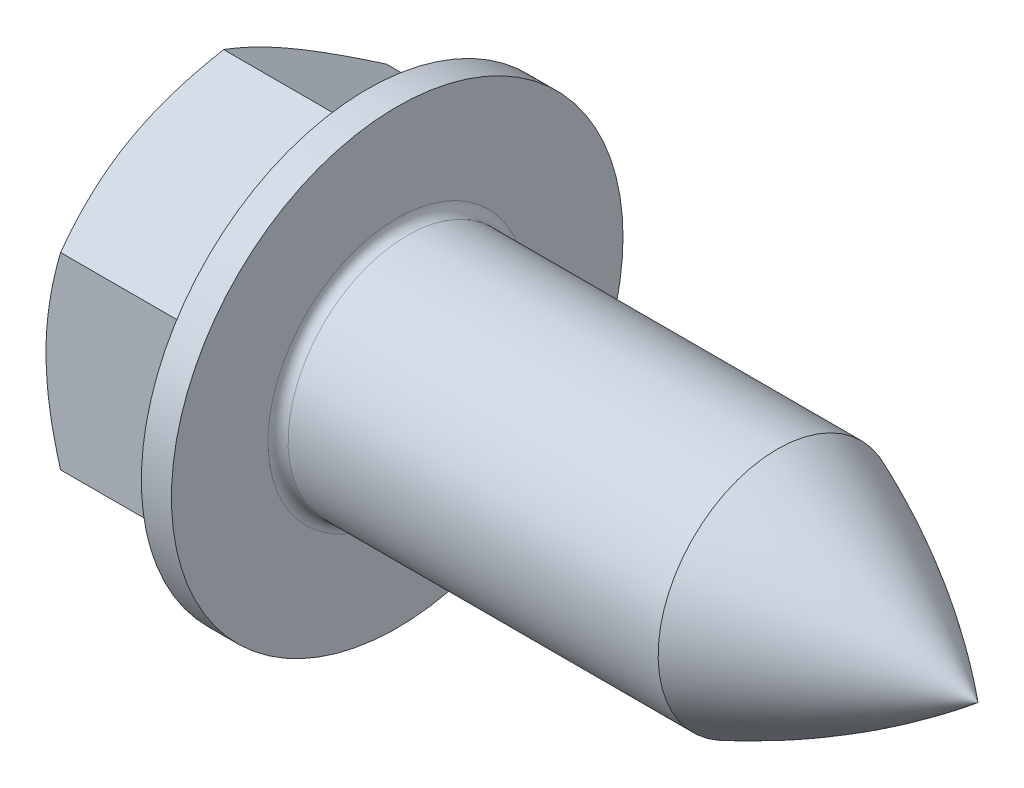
ISO-10303-21;
HEADER;
FILE_DESCRIPTION(('STEP AP214'),'2;1');
FILE_NAME('part.step','',(''),(''),'','','');
FILE_SCHEMA(('AUTOMOTIVE_DESIGN { 1 0 10303 214 1 1 1 1 }'));
ENDSEC;
DATA;
#1=APPLICATION_CONTEXT('core data for automotive mechanical design processes');
#2=APPLICATION_PROTOCOL_DEFINITION('international standard','automotive_design',2000,#1);
#3=PRODUCT_CONTEXT('',#1,'mechanical');
#4=PRODUCT('Part','Part','',(#3));
#5=PRODUCT_RELATED_PRODUCT_CATEGORY('part','',(#4));
#6=PRODUCT_DEFINITION_FORMATION('','',#4);
#7=PRODUCT_DEFINITION_CONTEXT('part definition',#1,'design');
#8=PRODUCT_DEFINITION('design','',#6,#7);
#9=PRODUCT_DEFINITION_SHAPE('','',#8);
#10=(LENGTH_UNIT() NAMED_UNIT(*) SI_UNIT(.MILLI.,.METRE.));
#11=(NAMED_UNIT(*) PLANE_ANGLE_UNIT() SI_UNIT($,.RADIAN.));
#12=(NAMED_UNIT(*) SI_UNIT($,.STERADIAN.) SOLID_ANGLE_UNIT());
#13=UNCERTAINTY_MEASURE_WITH_UNIT(LENGTH_MEASURE(1.E-05),#10,'distance_accuracy_value','');
#14=(GEOMETRIC_REPRESENTATION_CONTEXT(3) GLOBAL_UNCERTAINTY_ASSIGNED_CONTEXT((#13)) GLOBAL_UNIT_ASSIGNED_CONTEXT((#10,
#11,#12)) REPRESENTATION_CONTEXT('',''));
#15=CARTESIAN_POINT('',(0.,0.,0.));
#16=DIRECTION('',(0.,0.,1.));
#17=DIRECTION('',(1.,0.,0.));
#18=AXIS2_PLACEMENT_3D('',#15,#16,#17);
#19=CARTESIAN_POINT('',(-9.54447010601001,0.,0.));
#20=DIRECTION('',(-1.,0.,0.));
#21=DIRECTION('',(0.,0.,1.));
#22=AXIS2_PLACEMENT_3D('',#19,#20,#21);
#23=CYLINDRICAL_SURFACE('',#22,4.75);
#24=CARTESIAN_POINT('',(7.9,0.,0.));
#25=DIRECTION('',(1.,0.,0.));
#26=DIRECTION('',(0.,0.,-1.));
#27=AXIS2_PLACEMENT_3D('',#24,#25,#26);
#28=CIRCLE('',#27,4.75);
#29=CARTESIAN_POINT('',(7.9,0.,-4.75));
#30=VERTEX_POINT('',#29);
#31=EDGE_CURVE('E323',#30,#30,#28,.T.);
#32=ORIENTED_EDGE('',*,*,#31,.T.);
#33=EDGE_LOOP('',(#32));
#34=FACE_BOUND('',#33,.T.);
#35=CARTESIAN_POINT('',(22.65,0.,0.));
#36=DIRECTION('',(1.,0.,0.));
#37=DIRECTION('',(0.,1.,0.));
#38=AXIS2_PLACEMENT_3D('',#35,#36,#37);
#39=CIRCLE('',#38,4.75);
#40=CARTESIAN_POINT('',(22.65,4.75,0.));
#41=VERTEX_POINT('',#40);
#42=EDGE_CURVE('E301',#41,#41,#39,.T.);
#43=ORIENTED_EDGE('',*,*,#42,.F.);
#44=EDGE_LOOP('',(#43));
#45=FACE_BOUND('',#44,.T.);
#46=ADVANCED_FACE('F38',(#34,#45),#23,.T.);
#47=CARTESIAN_POINT('',(7.5,7.50555349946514,0.));
#48=DIRECTION('',(1.,0.,0.));
#49=DIRECTION('',(0.,0.,-1.));
#50=AXIS2_PLACEMENT_3D('',#47,#48,#49);
#51=PLANE('',#50);
#52=CARTESIAN_POINT('',(7.5,0.,0.));
#53=DIRECTION('',(1.,0.,0.));
#54=DIRECTION('',(0.,0.,-1.));
#55=AXIS2_PLACEMENT_3D('',#52,#53,#54);
#56=CIRCLE('',#55,5.15);
#57=CARTESIAN_POINT('',(7.5,0.,-5.15));
#58=VERTEX_POINT('',#57);
#59=EDGE_CURVE('E324',#58,#58,#56,.F.);
#60=ORIENTED_EDGE('',*,*,#59,.T.);
#61=EDGE_LOOP('',(#60));
#62=FACE_BOUND('',#61,.T.);
#63=CARTESIAN_POINT('',(7.49999999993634,0.,0.));
#64=DIRECTION('',(1.,0.,0.));
#65=DIRECTION('',(0.,0.,-1.));
#66=AXIS2_PLACEMENT_3D('',#63,#64,#65);
#67=CIRCLE('',#66,9.);
#68=CARTESIAN_POINT('',(7.49999999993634,0.,-9.));
#69=VERTEX_POINT('',#68);
#70=EDGE_CURVE('E346',#69,#69,#67,.T.);
#71=ORIENTED_EDGE('',*,*,#70,.T.);
#72=EDGE_LOOP('',(#71));
#73=FACE_BOUND('',#72,.T.);
#74=ADVANCED_FACE('F148',(#62,#73),#51,.T.);
#75=CARTESIAN_POINT('',(6.29999999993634,0.,0.));
#76=DIRECTION('',(1.,0.,0.));
#77=DIRECTION('',(0.,0.,-1.));
#78=AXIS2_PLACEMENT_3D('',#75,#76,#77);
#79=PLANE('',#78);
#80=DIRECTION('',(0.,-0.5,-0.866025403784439));
#81=VECTOR('',#80,1.);
#82=CARTESIAN_POINT('',(6.29999999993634,-8.0251687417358,0.299999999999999));
#83=LINE('',#82,#81);
#84=CARTESIAN_POINT('',(6.29999999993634,-4.09918691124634,7.1));
#85=VERTEX_POINT('',#84);
#86=CARTESIAN_POINT('',(6.29999999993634,-8.19837382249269,0.));
#87=VERTEX_POINT('',#86);
#88=EDGE_CURVE('E314',#85,#87,#83,.T.);
#89=ORIENTED_EDGE('',*,*,#88,.T.);
#90=DIRECTION('',(0.,0.5,-0.866025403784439));
#91=VECTOR('',#90,1.);
#92=CARTESIAN_POINT('',(6.29999999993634,-4.27239199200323,-6.8));
#93=LINE('',#92,#91);
#94=CARTESIAN_POINT('',(6.29999999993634,-4.09918691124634,-7.1));
#95=VERTEX_POINT('',#94);
#96=EDGE_CURVE('E311',#87,#95,#93,.T.);
#97=ORIENTED_EDGE('',*,*,#96,.T.);
#98=DIRECTION('',(0.,1.,0.));
#99=VECTOR('',#98,1.);
#100=CARTESIAN_POINT('',(6.29999999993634,3.75277674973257,-7.1));
#101=LINE('',#100,#99);
#102=CARTESIAN_POINT('',(6.29999999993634,4.09918691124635,-7.1));
#103=VERTEX_POINT('',#102);
#104=EDGE_CURVE('E321',#95,#103,#101,.T.);
#105=ORIENTED_EDGE('',*,*,#104,.T.);
#106=DIRECTION('',(0.,0.5,0.866025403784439));
#107=VECTOR('',#106,1.);
#108=CARTESIAN_POINT('',(6.29999999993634,8.0251687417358,-0.300000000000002));
#109=LINE('',#108,#107);
#110=CARTESIAN_POINT('',(6.29999999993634,8.19837382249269,0.));
#111=VERTEX_POINT('',#110);
#112=EDGE_CURVE('E319',#103,#111,#109,.T.);
#113=ORIENTED_EDGE('',*,*,#112,.T.);
#114=DIRECTION('',(0.,-0.5,0.866025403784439));
#115=VECTOR('',#114,1.);
#116=CARTESIAN_POINT('',(6.29999999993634,4.27239199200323,6.8));
#117=LINE('',#116,#115);
#118=CARTESIAN_POINT('',(6.29999999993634,4.09918691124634,7.1));
#119=VERTEX_POINT('',#118);
#120=EDGE_CURVE('E317',#111,#119,#117,.T.);
#121=ORIENTED_EDGE('',*,*,#120,.T.);
#122=DIRECTION('',(0.,-1.,0.));
#123=VECTOR('',#122,1.);
#124=CARTESIAN_POINT('',(6.29999999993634,-3.75277674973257,7.1));
#125=LINE('',#124,#123);
#126=EDGE_CURVE('E284',#119,#85,#125,.T.);
#127=ORIENTED_EDGE('',*,*,#126,.T.);
#128=EDGE_LOOP('',(#89,#97,#105,#113,#121,#127));
#129=FACE_BOUND('',#128,.T.);
#130=CARTESIAN_POINT('',(6.29999999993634,0.,0.));
#131=DIRECTION('',(1.,0.,0.));
#132=DIRECTION('',(0.,0.,-1.));
#133=AXIS2_PLACEMENT_3D('',#130,#131,#132);
#134=CIRCLE('',#133,9.);
#135=CARTESIAN_POINT('',(6.29999999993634,0.,-9.));
#136=VERTEX_POINT('',#135);
#137=EDGE_CURVE('E239',#136,#136,#134,.T.);
#138=ORIENTED_EDGE('',*,*,#137,.F.);
#139=EDGE_LOOP('',(#138));
#140=FACE_BOUND('',#139,.T.);
#141=ADVANCED_FACE('F154',(#129,#140),#79,.F.);
#142=CARTESIAN_POINT('',(6.29999999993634,0.,0.));
#143=DIRECTION('',(1.,0.,0.));
#144=DIRECTION('',(0.,0.,-1.));
#145=AXIS2_PLACEMENT_3D('',#142,#143,#144);
#146=CYLINDRICAL_SURFACE('',#145,9.);
#147=ORIENTED_EDGE('',*,*,#137,.T.);
#148=EDGE_LOOP('',(#147));
#149=FACE_BOUND('',#148,.T.);
#150=ORIENTED_EDGE('',*,*,#70,.F.);
#151=EDGE_LOOP('',(#150));
#152=FACE_BOUND('',#151,.T.);
#153=ADVANCED_FACE('F160',(#149,#152),#146,.T.);
#154=CARTESIAN_POINT('',(7.5,-3.75277674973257,-6.5));
#155=DIRECTION('',(0.,0.,1.));
#156=DIRECTION('',(0.,-1.,0.));
#157=AXIS2_PLACEMENT_3D('',#154,#155,#156);
#158=PLANE('',#157);
#159=DIRECTION('',(-1.,0.,0.));
#160=VECTOR('',#159,1.);
#161=CARTESIAN_POINT('',(7.5,3.75277674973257,-6.5));
#162=LINE('',#161,#160);
#163=CARTESIAN_POINT('',(5.69999999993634,3.75277674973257,-6.5));
#164=VERTEX_POINT('',#163);
#165=CARTESIAN_POINT('',(0.58055658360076,3.75277674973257,-6.5));
#166=VERTEX_POINT('',#165);
#167=EDGE_CURVE('E345',#164,#166,#162,.T.);
#168=ORIENTED_EDGE('',*,*,#167,.F.);
#169=DIRECTION('',(0.,1.,0.));
#170=VECTOR('',#169,1.);
#171=CARTESIAN_POINT('',(5.69999999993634,-3.75277674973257,-6.5));
#172=LINE('',#171,#170);
#173=CARTESIAN_POINT('',(5.69999999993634,-3.75277674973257,-6.5));
#174=VERTEX_POINT('',#173);
#175=EDGE_CURVE('E12',#164,#174,#172,.F.);
#176=ORIENTED_EDGE('',*,*,#175,.T.);
#177=DIRECTION('',(-1.,0.,0.));
#178=VECTOR('',#177,1.);
#179=CARTESIAN_POINT('',(7.5,-3.75277674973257,-6.5));
#180=LINE('',#179,#178);
#181=CARTESIAN_POINT('',(0.580556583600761,-3.75277674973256,-6.5));
#182=VERTEX_POINT('',#181);
#183=EDGE_CURVE('E343',#174,#182,#180,.T.);
#184=ORIENTED_EDGE('',*,*,#183,.T.);
#185=CARTESIAN_POINT('',(3.11042358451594,-9.95291698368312,-6.5));
#186=CARTESIAN_POINT('',(2.9725089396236,-9.66753022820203,-6.5));
#187=CARTESIAN_POINT('',(2.83596528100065,-9.38146872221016,-6.5));
#188=CARTESIAN_POINT('',(2.56640336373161,-8.80763137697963,-6.5));
#189=CARTESIAN_POINT('',(2.43338571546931,-8.51985525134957,-6.5));
#190=CARTESIAN_POINT('',(2.17095850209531,-7.94066929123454,-6.5));
#191=CARTESIAN_POINT('',(2.04157394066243,-7.64924808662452,-6.5));
#192=CARTESIAN_POINT('',(1.7883622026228,-7.06401043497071,-6.5));
#193=CARTESIAN_POINT('',(1.66453473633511,-6.77019411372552,-6.5));
#194=CARTESIAN_POINT('',(1.42244480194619,-6.17605150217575,-6.5));
#195=CARTESIAN_POINT('',(1.30426931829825,-5.87568957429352,-6.5));
#196=CARTESIAN_POINT('',(1.07717389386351,-5.27142269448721,-6.5));
#197=CARTESIAN_POINT('',(0.96825498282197,-4.96751735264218,-6.5));
#198=CARTESIAN_POINT('',(0.762599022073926,-4.3563054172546,-6.5));
#199=CARTESIAN_POINT('',(0.665836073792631,-4.04900762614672,-6.5));
#200=CARTESIAN_POINT('',(0.487635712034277,-3.43004022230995,-6.5));
#201=CARTESIAN_POINT('',(0.406193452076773,-3.11837202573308,-6.5));
#202=CARTESIAN_POINT('',(0.262584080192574,-2.49046594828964,-6.5));
#203=CARTESIAN_POINT('',(0.200422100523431,-2.17422687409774,-6.5));
#204=CARTESIAN_POINT('',(0.099574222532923,-1.5378916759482,-6.5));
#205=CARTESIAN_POINT('',(0.0608883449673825,-1.21779554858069,-6.5));
#206=CARTESIAN_POINT('',(0.0229465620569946,-0.737141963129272,-6.5));
#207=CARTESIAN_POINT('',(0.0136452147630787,-0.577336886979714,-6.5));
#208=CARTESIAN_POINT('',(0.00181408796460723,-0.25746890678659,-6.5));
#209=CARTESIAN_POINT('',(-0.000715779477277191,-0.0974060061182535,-6.5));
#210=CARTESIAN_POINT('',(0.00106401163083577,0.222635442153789,-6.5));
#211=CARTESIAN_POINT('',(0.00537175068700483,0.382614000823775,-6.5));
#212=CARTESIAN_POINT('',(0.0207175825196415,0.702250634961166,-6.5));
#213=CARTESIAN_POINT('',(0.0317560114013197,0.861908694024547,-6.5));
#214=CARTESIAN_POINT('',(0.0664368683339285,1.24887053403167,-6.5));
#215=CARTESIAN_POINT('',(0.0934518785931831,1.47587694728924,-6.5));
#216=CARTESIAN_POINT('',(0.159589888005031,1.928150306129,-6.5));
#217=CARTESIAN_POINT('',(0.198716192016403,2.15341675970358,-6.5));
#218=CARTESIAN_POINT('',(0.287689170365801,2.60202427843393,-6.5));
#219=CARTESIAN_POINT('',(0.33754598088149,2.82536331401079,-6.5));
#220=CARTESIAN_POINT('',(0.446458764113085,3.26974354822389,-6.5));
#221=CARTESIAN_POINT('',(0.505513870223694,3.49078496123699,-6.5));
#222=CARTESIAN_POINT('',(0.632954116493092,3.93601414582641,-6.5));
#223=CARTESIAN_POINT('',(0.701532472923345,4.16014622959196,-6.5));
#224=CARTESIAN_POINT('',(0.845465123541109,4.60604131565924,-6.5));
#225=CARTESIAN_POINT('',(0.920814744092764,4.82780583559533,-6.5));
#226=CARTESIAN_POINT('',(1.07673350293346,5.26807593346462,-6.5));
#227=CARTESIAN_POINT('',(1.15727087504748,5.48659282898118,-6.5));
#228=CARTESIAN_POINT('',(1.32307270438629,5.92193123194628,-6.5));
#229=CARTESIAN_POINT('',(1.4083390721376,6.13875201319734,-6.5));
#230=CARTESIAN_POINT('',(1.49550213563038,6.35478510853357,-6.5));
#231=B_SPLINE_CURVE_WITH_KNOTS('',3,(#185,#186,#187,#188,#189,#190,#191,#192,#193,#194,#195,
#196,#197,#198,#199,#200,#201,#202,#203,#204,#205,#206,#207,#208,#209,#210,#211,#212,#213,#214,
#215,#216,#217,#218,#219,#220,#221,#222,#223,#224,#225,#226,#227,#228,#229,#230),.UNSPECIFIED.,
.F.,.F.,(4,2,2,2,2,2,2,2,2,2,2,2,2,2,2,2,2,2,2,2,2,2,4),(0.,0.950904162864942,1.90197187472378,
2.85848216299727,3.81494253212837,4.78314526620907,5.7514555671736,6.71766655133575,
7.68357137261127,8.64973308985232,9.61589566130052,10.0960003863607,10.5760988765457,
11.0560626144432,11.5360503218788,12.2214931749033,12.9071232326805,13.5934038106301,
14.2796197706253,14.9826563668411,15.6852113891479,16.3838119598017,17.082696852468),.UNSPECIFIED.);
#232=CARTESIAN_POINT('',(0.,0.,-6.5));
#233=VERTEX_POINT('',#232);
#234=EDGE_CURVE('E186',#182,#233,#231,.T.);
#235=ORIENTED_EDGE('',*,*,#234,.T.);
#236=EDGE_CURVE('E178',#233,#166,#231,.T.);
#237=ORIENTED_EDGE('',*,*,#236,.T.);
#238=EDGE_LOOP('',(#168,#176,#184,#235,#237));
#239=FACE_BOUND('',#238,.T.);
#240=ADVANCED_FACE('F169',(#239),#158,.F.);
#241=CARTESIAN_POINT('',(7.5,-7.50555349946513,0.));
#242=DIRECTION('',(0.,0.866025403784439,0.5));
#243=DIRECTION('',(0.,-0.5,0.866025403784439));
#244=AXIS2_PLACEMENT_3D('',#241,#242,#243);
#245=PLANE('',#244);
#246=ORIENTED_EDGE('',*,*,#183,.F.);
#247=DIRECTION('',(0.,0.5,-0.866025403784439));
#248=VECTOR('',#247,1.);
#249=CARTESIAN_POINT('',(5.69999999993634,-7.50555349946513,0.));
#250=LINE('',#249,#248);
#251=CARTESIAN_POINT('',(5.69999999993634,-7.50555349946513,0.));
#252=VERTEX_POINT('',#251);
#253=EDGE_CURVE('E308',#174,#252,#250,.F.);
#254=ORIENTED_EDGE('',*,*,#253,.T.);
#255=DIRECTION('',(-1.,0.,0.));
#256=VECTOR('',#255,1.);
#257=CARTESIAN_POINT('',(7.5,-7.50555349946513,0.));
#258=LINE('',#257,#256);
#259=CARTESIAN_POINT('',(0.580556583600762,-7.50555349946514,0.));
#260=VERTEX_POINT('',#259);
#261=EDGE_CURVE('E341',#252,#260,#258,.T.);
#262=ORIENTED_EDGE('',*,*,#261,.T.);
#263=CARTESIAN_POINT('',(0.580623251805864,-7.50566896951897,0.00020000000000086));
#264=CARTESIAN_POINT('',(0.533004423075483,-7.4231786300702,-0.142677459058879));
#265=CARTESIAN_POINT('',(0.487546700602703,-7.34038072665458,-0.286087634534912));
#266=CARTESIAN_POINT('',(0.401548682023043,-7.17411251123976,-0.574072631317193));
#267=CARTESIAN_POINT('',(0.361010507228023,-7.09064192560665,-0.718647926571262));
#268=CARTESIAN_POINT('',(0.247571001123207,-6.83889369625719,-1.15468865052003));
#269=CARTESIAN_POINT('',(0.183047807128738,-6.66962231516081,-1.44787528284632));
#270=CARTESIAN_POINT('',(0.107386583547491,-6.41631077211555,-1.88662374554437));
#271=CARTESIAN_POINT('',(0.0858328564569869,-6.33302748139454,-2.03087463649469));
#272=CARTESIAN_POINT('',(0.0496903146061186,-6.16608458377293,-2.32002821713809));
#273=CARTESIAN_POINT('',(0.0351008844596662,-6.08242501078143,-2.46493084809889));
#274=CARTESIAN_POINT('',(0.0132587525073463,-5.91496056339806,-2.75498777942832));
#275=CARTESIAN_POINT('',(0.00599772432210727,-5.8311559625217,-2.90014160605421));
#276=CARTESIAN_POINT('',(-0.00103969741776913,-5.66347396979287,-3.19057533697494));
#277=CARTESIAN_POINT('',(-0.000816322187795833,-5.5795965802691,-3.33585523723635));
#278=CARTESIAN_POINT('',(0.0100834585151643,-5.34979921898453,-3.73387594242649));
#279=CARTESIAN_POINT('',(0.0283818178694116,-5.20395446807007,-3.98648646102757));
#280=CARTESIAN_POINT('',(0.0864063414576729,-4.91323365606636,-4.49002967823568));
#281=CARTESIAN_POINT('',(0.126152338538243,-4.76835861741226,-4.74096060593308));
#282=CARTESIAN_POINT('',(0.225505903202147,-4.47705272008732,-5.24551722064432));
#283=CARTESIAN_POINT('',(0.285534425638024,-4.33065861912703,-5.49907924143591));
#284=CARTESIAN_POINT('',(0.421774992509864,-4.04005357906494,-6.00242193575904));
#285=CARTESIAN_POINT('',(0.497955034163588,-3.89583891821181,-6.25220905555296));
#286=CARTESIAN_POINT('',(0.580623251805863,-3.75266127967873,-6.5002));
#287=B_SPLINE_CURVE_WITH_KNOTS('',3,(#263,#264,#265,#266,#267,#268,#269,#270,#271,#272,#273,
#274,#275,#276,#277,#278,#279,#280,#281,#282,#283,#284,#285,#286),.UNSPECIFIED.,.F.,.F.,(4,2,2,
2,2,2,2,2,2,2,2,4),(0.,0.515105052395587,1.03043143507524,2.06322554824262,2.56697389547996,
3.07067772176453,3.57380860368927,4.0769239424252,4.9527935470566,5.82947446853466,
6.72559912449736,7.61996451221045),.UNSPECIFIED.);
#288=CARTESIAN_POINT('',(0.,-5.62916512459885,-3.25));
#289=VERTEX_POINT('',#288);
#290=EDGE_CURVE('E229',#260,#289,#287,.T.);
#291=ORIENTED_EDGE('',*,*,#290,.T.);
#292=EDGE_CURVE('E223',#289,#182,#287,.T.);
#293=ORIENTED_EDGE('',*,*,#292,.T.);
#294=EDGE_LOOP('',(#246,#254,#262,#291,#293));
#295=FACE_BOUND('',#294,.T.);
#296=ADVANCED_FACE('F173',(#295),#245,.F.);
#297=CARTESIAN_POINT('',(7.5,-3.75277674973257,6.5));
#298=DIRECTION('',(0.,0.866025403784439,-0.5));
#299=DIRECTION('',(0.,0.5,0.866025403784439));
#300=AXIS2_PLACEMENT_3D('',#297,#298,#299);
#301=PLANE('',#300);
#302=ORIENTED_EDGE('',*,*,#261,.F.);
#303=DIRECTION('',(0.,-0.5,-0.866025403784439));
#304=VECTOR('',#303,1.);
#305=CARTESIAN_POINT('',(5.69999999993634,-3.75277674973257,6.5));
#306=LINE('',#305,#304);
#307=CARTESIAN_POINT('',(5.69999999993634,-3.75277674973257,6.5));
#308=VERTEX_POINT('',#307);
#309=EDGE_CURVE('E306',#252,#308,#306,.F.);
#310=ORIENTED_EDGE('',*,*,#309,.T.);
#311=DIRECTION('',(-1.,0.,0.));
#312=VECTOR('',#311,1.);
#313=CARTESIAN_POINT('',(7.5,-3.75277674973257,6.5));
#314=LINE('',#313,#312);
#315=CARTESIAN_POINT('',(0.580556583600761,-3.75277674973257,6.5));
#316=VERTEX_POINT('',#315);
#317=EDGE_CURVE('E337',#308,#316,#314,.T.);
#318=ORIENTED_EDGE('',*,*,#317,.T.);
#319=CARTESIAN_POINT('',(0.580623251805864,-3.75266127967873,6.5002));
#320=CARTESIAN_POINT('',(0.533004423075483,-3.8351516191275,6.35732254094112));
#321=CARTESIAN_POINT('',(0.487546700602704,-3.91794952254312,6.21391236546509));
#322=CARTESIAN_POINT('',(0.401548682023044,-4.08421773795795,5.9259273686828));
#323=CARTESIAN_POINT('',(0.361010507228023,-4.16768832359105,5.78135207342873));
#324=CARTESIAN_POINT('',(0.247571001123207,-4.41943655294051,5.34531134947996));
#325=CARTESIAN_POINT('',(0.183047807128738,-4.5887079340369,5.05212471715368));
#326=CARTESIAN_POINT('',(0.107386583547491,-4.84201947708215,4.61337625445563));
#327=CARTESIAN_POINT('',(0.0858328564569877,-4.92530276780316,4.46912536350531));
#328=CARTESIAN_POINT('',(0.0496903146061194,-5.09224566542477,4.17997178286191));
#329=CARTESIAN_POINT('',(0.0351008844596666,-5.17590523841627,4.03506915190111));
#330=CARTESIAN_POINT('',(0.0132587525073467,-5.34336968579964,3.74501222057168));
#331=CARTESIAN_POINT('',(0.0059977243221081,-5.427174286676,3.59985839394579));
#332=CARTESIAN_POINT('',(-0.00103969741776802,-5.59485627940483,3.30942466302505));
#333=CARTESIAN_POINT('',(-0.000816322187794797,-5.6787336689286,3.16414476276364));
#334=CARTESIAN_POINT('',(0.0100834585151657,-5.90853103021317,2.76612405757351));
#335=CARTESIAN_POINT('',(0.0283818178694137,-6.05437578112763,2.51351353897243));
#336=CARTESIAN_POINT('',(0.0864063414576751,-6.34509659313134,2.00997032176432));
#337=CARTESIAN_POINT('',(0.126152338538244,-6.48997163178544,1.75903939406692));
#338=CARTESIAN_POINT('',(0.225505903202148,-6.78127752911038,1.25448277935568));
#339=CARTESIAN_POINT('',(0.285534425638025,-6.92767163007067,1.00092075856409));
#340=CARTESIAN_POINT('',(0.421774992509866,-7.21827667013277,0.497578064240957));
#341=CARTESIAN_POINT('',(0.49795503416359,-7.36249133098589,0.247790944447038));
#342=CARTESIAN_POINT('',(0.580623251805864,-7.50566896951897,-0.000199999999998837));
#343=B_SPLINE_CURVE_WITH_KNOTS('',3,(#319,#320,#321,#322,#323,#324,#325,#326,#327,#328,#329,
#330,#331,#332,#333,#334,#335,#336,#337,#338,#339,#340,#341,#342),.UNSPECIFIED.,.F.,.F.,(4,2,2,
2,2,2,2,2,2,2,2,4),(0.,0.515105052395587,1.03043143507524,2.06322554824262,2.56697389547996,
3.07067772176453,3.57380860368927,4.0769239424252,4.9527935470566,5.82947446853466,
6.72559912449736,7.61996451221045),.UNSPECIFIED.);
#344=CARTESIAN_POINT('',(0.,-5.62916512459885,3.25));
#345=VERTEX_POINT('',#344);
#346=EDGE_CURVE('E237',#316,#345,#343,.T.);
#347=ORIENTED_EDGE('',*,*,#346,.T.);
#348=EDGE_CURVE('E230',#345,#260,#343,.T.);
#349=ORIENTED_EDGE('',*,*,#348,.T.);
#350=EDGE_LOOP('',(#302,#310,#318,#347,#349));
#351=FACE_BOUND('',#350,.T.);
#352=ADVANCED_FACE('F241',(#351),#301,.F.);
#353=CARTESIAN_POINT('',(7.5,3.75277674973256,6.5));
#354=DIRECTION('',(0.,0.,-1.));
#355=DIRECTION('',(0.,1.,0.));
#356=AXIS2_PLACEMENT_3D('',#353,#354,#355);
#357=PLANE('',#356);
#358=ORIENTED_EDGE('',*,*,#317,.F.);
#359=DIRECTION('',(0.,-1.,0.));
#360=VECTOR('',#359,1.);
#361=CARTESIAN_POINT('',(5.69999999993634,3.75277674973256,6.5));
#362=LINE('',#361,#360);
#363=CARTESIAN_POINT('',(5.69999999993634,3.75277674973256,6.5));
#364=VERTEX_POINT('',#363);
#365=EDGE_CURVE('E282',#308,#364,#362,.F.);
#366=ORIENTED_EDGE('',*,*,#365,.T.);
#367=DIRECTION('',(-1.,0.,0.));
#368=VECTOR('',#367,1.);
#369=CARTESIAN_POINT('',(7.5,3.75277674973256,6.5));
#370=LINE('',#369,#368);
#371=CARTESIAN_POINT('',(0.58055658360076,3.75277674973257,6.5));
#372=VERTEX_POINT('',#371);
#373=EDGE_CURVE('E334',#364,#372,#370,.T.);
#374=ORIENTED_EDGE('',*,*,#373,.T.);
#375=CARTESIAN_POINT('',(3.11042358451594,-9.95291698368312,6.5));
#376=CARTESIAN_POINT('',(2.9725089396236,-9.66753022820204,6.5));
#377=CARTESIAN_POINT('',(2.83596528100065,-9.38146872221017,6.5));
#378=CARTESIAN_POINT('',(2.56640336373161,-8.80763137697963,6.5));
#379=CARTESIAN_POINT('',(2.43338571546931,-8.51985525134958,6.5));
#380=CARTESIAN_POINT('',(2.17095850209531,-7.94066929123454,6.5));
#381=CARTESIAN_POINT('',(2.04157394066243,-7.64924808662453,6.5));
#382=CARTESIAN_POINT('',(1.7883622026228,-7.06401043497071,6.5));
#383=CARTESIAN_POINT('',(1.66453473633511,-6.77019411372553,6.5));
#384=CARTESIAN_POINT('',(1.42244480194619,-6.17605150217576,6.5));
#385=CARTESIAN_POINT('',(1.30426931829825,-5.87568957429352,6.5));
#386=CARTESIAN_POINT('',(1.07717389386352,-5.27142269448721,6.5));
#387=CARTESIAN_POINT('',(0.968254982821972,-4.96751735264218,6.5));
#388=CARTESIAN_POINT('',(0.762599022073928,-4.3563054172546,6.5));
#389=CARTESIAN_POINT('',(0.665836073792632,-4.04900762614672,6.5));
#390=CARTESIAN_POINT('',(0.487635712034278,-3.43004022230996,6.5));
#391=CARTESIAN_POINT('',(0.406193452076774,-3.11837202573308,6.5));
#392=CARTESIAN_POINT('',(0.262584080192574,-2.49046594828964,6.5));
#393=CARTESIAN_POINT('',(0.200422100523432,-2.17422687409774,6.5));
#394=CARTESIAN_POINT('',(0.0995742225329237,-1.5378916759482,6.5));
#395=CARTESIAN_POINT('',(0.0608883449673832,-1.21779554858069,6.5));
#396=CARTESIAN_POINT('',(0.0229465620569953,-0.737141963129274,6.5));
#397=CARTESIAN_POINT('',(0.0136452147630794,-0.577336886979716,6.5));
#398=CARTESIAN_POINT('',(0.001814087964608,-0.257468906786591,6.5));
#399=CARTESIAN_POINT('',(-0.000715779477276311,-0.097406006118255,6.5));
#400=CARTESIAN_POINT('',(0.0010640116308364,0.222635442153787,6.5));
#401=CARTESIAN_POINT('',(0.0053717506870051,0.382614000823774,6.5));
#402=CARTESIAN_POINT('',(0.0207175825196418,0.702250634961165,6.5));
#403=CARTESIAN_POINT('',(0.0317560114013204,0.861908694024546,6.5));
#404=CARTESIAN_POINT('',(0.0664368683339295,1.24887053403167,6.5));
#405=CARTESIAN_POINT('',(0.0934518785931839,1.47587694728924,6.5));
#406=CARTESIAN_POINT('',(0.159589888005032,1.92815030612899,6.5));
#407=CARTESIAN_POINT('',(0.198716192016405,2.15341675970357,6.5));
#408=CARTESIAN_POINT('',(0.287689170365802,2.60202427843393,6.5));
#409=CARTESIAN_POINT('',(0.33754598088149,2.82536331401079,6.5));
#410=CARTESIAN_POINT('',(0.446458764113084,3.26974354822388,6.5));
#411=CARTESIAN_POINT('',(0.505513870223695,3.49078496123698,6.5));
#412=CARTESIAN_POINT('',(0.632954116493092,3.9360141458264,6.5));
#413=CARTESIAN_POINT('',(0.701532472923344,4.16014622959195,6.5));
#414=CARTESIAN_POINT('',(0.845465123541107,4.60604131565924,6.5));
#415=CARTESIAN_POINT('',(0.920814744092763,4.82780583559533,6.5));
#416=CARTESIAN_POINT('',(1.07673350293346,5.26807593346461,6.5));
#417=CARTESIAN_POINT('',(1.15727087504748,5.48659282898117,6.5));
#418=CARTESIAN_POINT('',(1.32307270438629,5.92193123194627,6.5));
#419=CARTESIAN_POINT('',(1.4083390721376,6.13875201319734,6.5));
#420=CARTESIAN_POINT('',(1.49550213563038,6.35478510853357,6.5));
#421=B_SPLINE_CURVE_WITH_KNOTS('',3,(#375,#376,#377,#378,#379,#380,#381,#382,#383,#384,#385,
#386,#387,#388,#389,#390,#391,#392,#393,#394,#395,#396,#397,#398,#399,#400,#401,#402,#403,#404,
#405,#406,#407,#408,#409,#410,#411,#412,#413,#414,#415,#416,#417,#418,#419,#420),.UNSPECIFIED.,
.F.,.F.,(4,2,2,2,2,2,2,2,2,2,2,2,2,2,2,2,2,2,2,2,2,2,4),(0.,0.95090416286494,1.90197187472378,
2.85848216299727,3.81494253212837,4.78314526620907,5.7514555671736,6.71766655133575,
7.68357137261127,8.64973308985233,9.61589566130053,10.0960003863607,10.5760988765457,
11.0560626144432,11.5360503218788,12.2214931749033,12.9071232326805,13.5934038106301,
14.2796197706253,14.9826563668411,15.6852113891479,16.3838119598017,17.082696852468),.UNSPECIFIED.);
#422=CARTESIAN_POINT('',(0.,0.,6.5));
#423=VERTEX_POINT('',#422);
#424=EDGE_CURVE('E194',#372,#423,#421,.F.);
#425=ORIENTED_EDGE('',*,*,#424,.T.);
#426=EDGE_CURVE('E238',#423,#316,#421,.F.);
#427=ORIENTED_EDGE('',*,*,#426,.T.);
#428=EDGE_LOOP('',(#358,#366,#374,#425,#427));
#429=FACE_BOUND('',#428,.T.);
#430=ADVANCED_FACE('F244',(#429),#357,.F.);
#431=CARTESIAN_POINT('',(7.5,7.50555349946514,0.));
#432=DIRECTION('',(0.,-0.866025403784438,-0.5));
#433=DIRECTION('',(0.,0.5,-0.866025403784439));
#434=AXIS2_PLACEMENT_3D('',#431,#432,#433);
#435=PLANE('',#434);
#436=ORIENTED_EDGE('',*,*,#373,.F.);
#437=DIRECTION('',(0.,-0.5,0.866025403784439));
#438=VECTOR('',#437,1.);
#439=CARTESIAN_POINT('',(5.69999999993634,7.50555349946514,0.));
#440=LINE('',#439,#438);
#441=CARTESIAN_POINT('',(5.69999999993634,7.50555349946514,0.));
#442=VERTEX_POINT('',#441);
#443=EDGE_CURVE('E62',#364,#442,#440,.F.);
#444=ORIENTED_EDGE('',*,*,#443,.T.);
#445=DIRECTION('',(-1.,0.,0.));
#446=VECTOR('',#445,1.);
#447=CARTESIAN_POINT('',(7.5,7.50555349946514,0.));
#448=LINE('',#447,#446);
#449=CARTESIAN_POINT('',(0.58055658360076,7.50555349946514,0.));
#450=VERTEX_POINT('',#449);
#451=EDGE_CURVE('E332',#442,#450,#448,.T.);
#452=ORIENTED_EDGE('',*,*,#451,.T.);
#453=CARTESIAN_POINT('',(0.580623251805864,7.50566896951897,-0.000200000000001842));
#454=CARTESIAN_POINT('',(0.533004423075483,7.4231786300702,0.142677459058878));
#455=CARTESIAN_POINT('',(0.487546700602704,7.34038072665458,0.286087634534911));
#456=CARTESIAN_POINT('',(0.401548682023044,7.17411251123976,0.574072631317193));
#457=CARTESIAN_POINT('',(0.361010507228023,7.09064192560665,0.718647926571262));
#458=CARTESIAN_POINT('',(0.247571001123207,6.83889369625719,1.15468865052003));
#459=CARTESIAN_POINT('',(0.183047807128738,6.66962231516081,1.44787528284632));
#460=CARTESIAN_POINT('',(0.107386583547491,6.41631077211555,1.88662374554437));
#461=CARTESIAN_POINT('',(0.0858328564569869,6.33302748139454,2.03087463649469));
#462=CARTESIAN_POINT('',(0.0496903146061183,6.16608458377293,2.32002821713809));
#463=CARTESIAN_POINT('',(0.0351008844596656,6.08242501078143,2.46493084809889));
#464=CARTESIAN_POINT('',(0.013258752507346,5.91496056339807,2.75498777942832));
#465=CARTESIAN_POINT('',(0.00599772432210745,5.8311559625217,2.90014160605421));
#466=CARTESIAN_POINT('',(-0.00103969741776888,5.66347396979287,3.19057533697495));
#467=CARTESIAN_POINT('',(-0.000816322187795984,5.5795965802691,3.33585523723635));
#468=CARTESIAN_POINT('',(0.010083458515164,5.34979921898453,3.73387594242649));
#469=CARTESIAN_POINT('',(0.028381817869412,5.20395446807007,3.98648646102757));
#470=CARTESIAN_POINT('',(0.0864063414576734,4.91323365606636,4.49002967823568));
#471=CARTESIAN_POINT('',(0.126152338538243,4.76835861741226,4.74096060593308));
#472=CARTESIAN_POINT('',(0.225505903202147,4.47705272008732,5.24551722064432));
#473=CARTESIAN_POINT('',(0.285534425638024,4.33065861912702,5.49907924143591));
#474=CARTESIAN_POINT('',(0.421774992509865,4.04005357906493,6.00242193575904));
#475=CARTESIAN_POINT('',(0.49795503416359,3.89583891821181,6.25220905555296));
#476=CARTESIAN_POINT('',(0.580623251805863,3.75266127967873,6.5002));
#477=B_SPLINE_CURVE_WITH_KNOTS('',3,(#453,#454,#455,#456,#457,#458,#459,#460,#461,#462,#463,
#464,#465,#466,#467,#468,#469,#470,#471,#472,#473,#474,#475,#476),.UNSPECIFIED.,.F.,.F.,(4,2,2,
2,2,2,2,2,2,2,2,4),(0.,0.515105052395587,1.03043143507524,2.06322554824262,2.56697389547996,
3.07067772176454,3.57380860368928,4.0769239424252,4.9527935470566,5.82947446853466,
6.72559912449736,7.61996451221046),.UNSPECIFIED.);
#478=CARTESIAN_POINT('',(0.,5.62916512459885,3.25));
#479=VERTEX_POINT('',#478);
#480=EDGE_CURVE('E187',#450,#479,#477,.T.);
#481=ORIENTED_EDGE('',*,*,#480,.T.);
#482=EDGE_CURVE('E574',#479,#372,#477,.T.);
#483=ORIENTED_EDGE('',*,*,#482,.T.);
#484=EDGE_LOOP('',(#436,#444,#452,#481,#483));
#485=FACE_BOUND('',#484,.T.);
#486=ADVANCED_FACE('F248',(#485),#435,.F.);
#487=CARTESIAN_POINT('',(7.5,3.75277674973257,-6.5));
#488=DIRECTION('',(0.,-0.866025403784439,0.5));
#489=DIRECTION('',(0.,-0.5,-0.866025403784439));
#490=AXIS2_PLACEMENT_3D('',#487,#488,#489);
#491=PLANE('',#490);
#492=ORIENTED_EDGE('',*,*,#451,.F.);
#493=DIRECTION('',(0.,0.5,0.866025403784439));
#494=VECTOR('',#493,1.);
#495=CARTESIAN_POINT('',(5.69999999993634,3.75277674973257,-6.5));
#496=LINE('',#495,#494);
#497=EDGE_CURVE('E47',#442,#164,#496,.F.);
#498=ORIENTED_EDGE('',*,*,#497,.T.);
#499=ORIENTED_EDGE('',*,*,#167,.T.);
#500=CARTESIAN_POINT('',(0.580623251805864,3.75266127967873,-6.5002));
#501=CARTESIAN_POINT('',(0.533004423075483,3.83515161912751,-6.35732254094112));
#502=CARTESIAN_POINT('',(0.487546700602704,3.91794952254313,-6.21391236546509));
#503=CARTESIAN_POINT('',(0.401548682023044,4.08421773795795,-5.9259273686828));
#504=CARTESIAN_POINT('',(0.361010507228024,4.16768832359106,-5.78135207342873));
#505=CARTESIAN_POINT('',(0.247571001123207,4.41943655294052,-5.34531134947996));
#506=CARTESIAN_POINT('',(0.183047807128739,4.5887079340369,-5.05212471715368));
#507=CARTESIAN_POINT('',(0.107386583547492,4.84201947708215,-4.61337625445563));
#508=CARTESIAN_POINT('',(0.0858328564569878,4.92530276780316,-4.46912536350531));
#509=CARTESIAN_POINT('',(0.0496903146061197,5.09224566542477,-4.17997178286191));
#510=CARTESIAN_POINT('',(0.0351008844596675,5.17590523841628,-4.03506915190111));
#511=CARTESIAN_POINT('',(0.0132587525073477,5.34336968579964,-3.74501222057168));
#512=CARTESIAN_POINT('',(0.00599772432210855,5.427174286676,-3.59985839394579));
#513=CARTESIAN_POINT('',(-0.00103969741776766,5.59485627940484,-3.30942466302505));
#514=CARTESIAN_POINT('',(-0.000816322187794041,5.6787336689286,-3.16414476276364));
#515=CARTESIAN_POINT('',(0.0100834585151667,5.90853103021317,-2.76612405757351));
#516=CARTESIAN_POINT('',(0.0283818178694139,6.05437578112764,-2.51351353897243));
#517=CARTESIAN_POINT('',(0.0864063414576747,6.34509659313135,-2.00997032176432));
#518=CARTESIAN_POINT('',(0.126152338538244,6.48997163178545,-1.75903939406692));
#519=CARTESIAN_POINT('',(0.225505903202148,6.78127752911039,-1.25448277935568));
#520=CARTESIAN_POINT('',(0.285534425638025,6.92767163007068,-1.00092075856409));
#521=CARTESIAN_POINT('',(0.421774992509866,7.21827667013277,-0.497578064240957));
#522=CARTESIAN_POINT('',(0.49795503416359,7.36249133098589,-0.247790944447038));
#523=CARTESIAN_POINT('',(0.580623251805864,7.50566896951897,0.000199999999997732));
#524=B_SPLINE_CURVE_WITH_KNOTS('',3,(#500,#501,#502,#503,#504,#505,#506,#507,#508,#509,#510,
#511,#512,#513,#514,#515,#516,#517,#518,#519,#520,#521,#522,#523),.UNSPECIFIED.,.F.,.F.,(4,2,2,
2,2,2,2,2,2,2,2,4),(0.,0.515105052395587,1.03043143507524,2.06322554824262,2.56697389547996,
3.07067772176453,3.57380860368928,4.0769239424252,4.9527935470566,5.82947446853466,
6.72559912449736,7.61996451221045),.UNSPECIFIED.);
#525=CARTESIAN_POINT('',(0.,5.62916512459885,-3.25));
#526=VERTEX_POINT('',#525);
#527=EDGE_CURVE('E326',#166,#526,#524,.T.);
#528=ORIENTED_EDGE('',*,*,#527,.T.);
#529=EDGE_CURVE('E211',#526,#450,#524,.T.);
#530=ORIENTED_EDGE('',*,*,#529,.T.);
#531=EDGE_LOOP('',(#492,#498,#499,#528,#530));
#532=FACE_BOUND('',#531,.T.);
#533=ADVANCED_FACE('F252',(#532),#491,.F.);
#534=CARTESIAN_POINT('',(0.,0.,0.));
#535=DIRECTION('',(1.,0.,0.));
#536=DIRECTION('',(0.,1.,0.));
#537=AXIS2_PLACEMENT_3D('',#534,#535,#536);
#538=CONICAL_SURFACE('',#537,6.5,1.0471975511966);
#539=ORIENTED_EDGE('',*,*,#529,.F.);
#540=CARTESIAN_POINT('',(0.,0.,0.));
#541=DIRECTION('',(1.,0.,0.));
#542=DIRECTION('',(0.,1.,0.));
#543=AXIS2_PLACEMENT_3D('',#540,#541,#542);
#544=CIRCLE('',#543,6.5);
#545=EDGE_CURVE('E286',#526,#479,#544,.T.);
#546=ORIENTED_EDGE('',*,*,#545,.T.);
#547=ORIENTED_EDGE('',*,*,#480,.F.);
#548=EDGE_LOOP('',(#539,#546,#547));
#549=FACE_BOUND('',#548,.T.);
#550=ADVANCED_FACE('F207',(#549),#538,.T.);
#551=EDGE_CURVE('E288',#233,#526,#544,.T.);
#552=ORIENTED_EDGE('',*,*,#551,.T.);
#553=ORIENTED_EDGE('',*,*,#527,.F.);
#554=ORIENTED_EDGE('',*,*,#236,.F.);
#555=EDGE_LOOP('',(#552,#553,#554));
#556=FACE_BOUND('',#555,.T.);
#557=ADVANCED_FACE('F544',(#556),#538,.T.);
#558=ORIENTED_EDGE('',*,*,#482,.F.);
#559=EDGE_CURVE('E289',#479,#423,#544,.T.);
#560=ORIENTED_EDGE('',*,*,#559,.T.);
#561=ORIENTED_EDGE('',*,*,#424,.F.);
#562=EDGE_LOOP('',(#558,#560,#561));
#563=FACE_BOUND('',#562,.T.);
#564=ADVANCED_FACE('F205',(#563),#538,.T.);
#565=ORIENTED_EDGE('',*,*,#426,.F.);
#566=EDGE_CURVE('E368',#423,#345,#544,.T.);
#567=ORIENTED_EDGE('',*,*,#566,.T.);
#568=ORIENTED_EDGE('',*,*,#346,.F.);
#569=EDGE_LOOP('',(#565,#567,#568));
#570=FACE_BOUND('',#569,.T.);
#571=ADVANCED_FACE('F201',(#570),#538,.T.);
#572=EDGE_CURVE('E365',#345,#289,#544,.T.);
#573=ORIENTED_EDGE('',*,*,#572,.T.);
#574=ORIENTED_EDGE('',*,*,#290,.F.);
#575=ORIENTED_EDGE('',*,*,#348,.F.);
#576=EDGE_LOOP('',(#573,#574,#575));
#577=FACE_BOUND('',#576,.T.);
#578=ADVANCED_FACE('F204',(#577),#538,.T.);
#579=EDGE_CURVE('E370',#289,#233,#544,.T.);
#580=ORIENTED_EDGE('',*,*,#579,.T.);
#581=ORIENTED_EDGE('',*,*,#234,.F.);
#582=ORIENTED_EDGE('',*,*,#292,.F.);
#583=EDGE_LOOP('',(#580,#581,#582));
#584=FACE_BOUND('',#583,.T.);
#585=ADVANCED_FACE('F167',(#584),#538,.T.);
#586=CARTESIAN_POINT('',(0.,7.50555349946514,0.));
#587=DIRECTION('',(1.,0.,0.));
#588=DIRECTION('',(0.,0.,-1.));
#589=AXIS2_PLACEMENT_3D('',#586,#587,#588);
#590=PLANE('',#589);
#591=CARTESIAN_POINT('',(0.,0.,0.));
#592=DIRECTION('',(1.,0.,0.));
#593=DIRECTION('',(0.,0.,-1.));
#594=AXIS2_PLACEMENT_3D('',#591,#592,#593);
#595=CIRCLE('',#594,5.41666666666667);
#596=CARTESIAN_POINT('',(0.,0.,-5.41666666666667));
#597=VERTEX_POINT('',#596);
#598=EDGE_CURVE('E42',#597,#597,#595,.T.);
#599=ORIENTED_EDGE('',*,*,#598,.T.);
#600=EDGE_LOOP('',(#599));
#601=FACE_BOUND('',#600,.T.);
#602=ORIENTED_EDGE('',*,*,#551,.F.);
#603=ORIENTED_EDGE('',*,*,#579,.F.);
#604=ORIENTED_EDGE('',*,*,#572,.F.);
#605=ORIENTED_EDGE('',*,*,#566,.F.);
#606=ORIENTED_EDGE('',*,*,#559,.F.);
#607=ORIENTED_EDGE('',*,*,#545,.F.);
#608=EDGE_LOOP('',(#602,#603,#604,#605,#606,#607));
#609=FACE_BOUND('',#608,.T.);
#610=ADVANCED_FACE('F163',(#601,#609),#590,.F.);
#611=CARTESIAN_POINT('',(7.9,0.,0.));
#612=DIRECTION('',(1.,0.,0.));
#613=DIRECTION('',(0.,0.,-1.));
#614=AXIS2_PLACEMENT_3D('',#611,#612,#613);
#615=TOROIDAL_SURFACE('',#614,5.15,0.4);
#616=ORIENTED_EDGE('',*,*,#31,.F.);
#617=EDGE_LOOP('',(#616));
#618=FACE_BOUND('',#617,.T.);
#619=ORIENTED_EDGE('',*,*,#59,.F.);
#620=EDGE_LOOP('',(#619));
#621=FACE_BOUND('',#620,.T.);
#622=ADVANCED_FACE('F166',(#618,#621),#615,.F.);
#623=CARTESIAN_POINT('',(5.69999999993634,6.14878036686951,3.55));
#624=DIRECTION('',(0.,0.5,-0.866025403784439));
#625=DIRECTION('',(0.,0.866025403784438,0.5));
#626=AXIS2_PLACEMENT_3D('',#623,#624,#625);
#627=CYLINDRICAL_SURFACE('',#626,0.6);
#628=CARTESIAN_POINT('',(5.69999999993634,8.19837382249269,0.));
#629=DIRECTION('',(0.,0.,-1.));
#630=DIRECTION('',(0.,-1.,0.));
#631=AXIS2_PLACEMENT_3D('',#628,#629,#630);
#632=ELLIPSE('',#631,0.692820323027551,0.6);
#633=EDGE_CURVE('E287',#442,#111,#632,.F.);
#634=ORIENTED_EDGE('',*,*,#633,.F.);
#635=ORIENTED_EDGE('',*,*,#443,.F.);
#636=CARTESIAN_POINT('',(5.69999999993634,4.09918691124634,7.1));
#637=DIRECTION('',(0.,0.866025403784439,-0.5));
#638=DIRECTION('',(0.,-0.5,-0.866025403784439));
#639=AXIS2_PLACEMENT_3D('',#636,#637,#638);
#640=ELLIPSE('',#639,0.692820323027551,0.6);
#641=EDGE_CURVE('E280',#119,#364,#640,.T.);
#642=ORIENTED_EDGE('',*,*,#641,.F.);
#643=ORIENTED_EDGE('',*,*,#120,.F.);
#644=EDGE_LOOP('',(#634,#635,#642,#643));
#645=FACE_BOUND('',#644,.T.);
#646=ADVANCED_FACE('F40',(#645),#627,.F.);
#647=CARTESIAN_POINT('',(5.69999999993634,0.,7.1));
#648=DIRECTION('',(0.,1.,0.));
#649=DIRECTION('',(0.,0.,1.));
#650=AXIS2_PLACEMENT_3D('',#647,#648,#649);
#651=CYLINDRICAL_SURFACE('',#650,0.6);
#652=ORIENTED_EDGE('',*,*,#641,.T.);
#653=ORIENTED_EDGE('',*,*,#365,.F.);
#654=CARTESIAN_POINT('',(5.69999999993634,-4.09918691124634,7.1));
#655=DIRECTION('',(0.,0.866025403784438,0.5));
#656=DIRECTION('',(0.,0.5,-0.866025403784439));
#657=AXIS2_PLACEMENT_3D('',#654,#655,#656);
#658=ELLIPSE('',#657,0.692820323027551,0.6);
#659=EDGE_CURVE('E291',#85,#308,#658,.T.);
#660=ORIENTED_EDGE('',*,*,#659,.F.);
#661=ORIENTED_EDGE('',*,*,#126,.F.);
#662=EDGE_LOOP('',(#652,#653,#660,#661));
#663=FACE_BOUND('',#662,.T.);
#664=ADVANCED_FACE('F268',(#663),#651,.F.);
#665=CARTESIAN_POINT('',(5.69999999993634,6.14878036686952,-3.55));
#666=DIRECTION('',(0.,-0.5,-0.866025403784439));
#667=DIRECTION('',(0.,0.866025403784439,-0.5));
#668=AXIS2_PLACEMENT_3D('',#665,#666,#667);
#669=CYLINDRICAL_SURFACE('',#668,0.6);
#670=ORIENTED_EDGE('',*,*,#633,.T.);
#671=ORIENTED_EDGE('',*,*,#112,.F.);
#672=CARTESIAN_POINT('',(5.69999999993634,4.09918691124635,-7.1));
#673=DIRECTION('',(0.,-0.866025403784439,-0.5));
#674=DIRECTION('',(0.,-0.5,0.866025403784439));
#675=AXIS2_PLACEMENT_3D('',#672,#673,#674);
#676=ELLIPSE('',#675,0.692820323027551,0.6);
#677=EDGE_CURVE('E295',#164,#103,#676,.F.);
#678=ORIENTED_EDGE('',*,*,#677,.F.);
#679=ORIENTED_EDGE('',*,*,#497,.F.);
#680=EDGE_LOOP('',(#670,#671,#678,#679));
#681=FACE_BOUND('',#680,.T.);
#682=ADVANCED_FACE('F265',(#681),#669,.F.);
#683=CARTESIAN_POINT('',(5.69999999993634,-6.14878036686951,3.55));
#684=DIRECTION('',(0.,0.5,0.866025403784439));
#685=DIRECTION('',(0.,-0.866025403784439,0.5));
#686=AXIS2_PLACEMENT_3D('',#683,#684,#685);
#687=CYLINDRICAL_SURFACE('',#686,0.6);
#688=ORIENTED_EDGE('',*,*,#659,.T.);
#689=ORIENTED_EDGE('',*,*,#309,.F.);
#690=CARTESIAN_POINT('',(5.69999999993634,-8.19837382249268,0.));
#691=DIRECTION('',(0.,0.,1.));
#692=DIRECTION('',(0.,1.,0.));
#693=AXIS2_PLACEMENT_3D('',#690,#691,#692);
#694=ELLIPSE('',#693,0.692820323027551,0.6);
#695=EDGE_CURVE('E298',#87,#252,#694,.T.);
#696=ORIENTED_EDGE('',*,*,#695,.F.);
#697=ORIENTED_EDGE('',*,*,#88,.F.);
#698=EDGE_LOOP('',(#688,#689,#696,#697));
#699=FACE_BOUND('',#698,.T.);
#700=ADVANCED_FACE('F261',(#699),#687,.F.);
#701=CARTESIAN_POINT('',(5.69999999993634,0.,-7.1));
#702=DIRECTION('',(0.,-1.,0.));
#703=DIRECTION('',(0.,0.,-1.));
#704=AXIS2_PLACEMENT_3D('',#701,#702,#703);
#705=CYLINDRICAL_SURFACE('',#704,0.6);
#706=ORIENTED_EDGE('',*,*,#677,.T.);
#707=ORIENTED_EDGE('',*,*,#104,.F.);
#708=CARTESIAN_POINT('',(5.69999999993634,-4.09918691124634,-7.1));
#709=DIRECTION('',(0.,-0.866025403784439,0.5));
#710=DIRECTION('',(0.,-0.5,-0.866025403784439));
#711=AXIS2_PLACEMENT_3D('',#708,#709,#710);
#712=ELLIPSE('',#711,0.692820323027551,0.6);
#713=EDGE_CURVE('E300',#174,#95,#712,.F.);
#714=ORIENTED_EDGE('',*,*,#713,.F.);
#715=ORIENTED_EDGE('',*,*,#175,.F.);
#716=EDGE_LOOP('',(#706,#707,#714,#715));
#717=FACE_BOUND('',#716,.T.);
#718=ADVANCED_FACE('F142',(#717),#705,.F.);
#719=CARTESIAN_POINT('',(5.69999999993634,-6.14878036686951,-3.55));
#720=DIRECTION('',(0.,-0.5,0.866025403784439));
#721=DIRECTION('',(0.,-0.866025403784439,-0.5));
#722=AXIS2_PLACEMENT_3D('',#719,#720,#721);
#723=CYLINDRICAL_SURFACE('',#722,0.6);
#724=ORIENTED_EDGE('',*,*,#695,.T.);
#725=ORIENTED_EDGE('',*,*,#253,.F.);
#726=ORIENTED_EDGE('',*,*,#713,.T.);
#727=ORIENTED_EDGE('',*,*,#96,.F.);
#728=EDGE_LOOP('',(#724,#725,#726,#727));
#729=FACE_BOUND('',#728,.T.);
#730=ADVANCED_FACE('F132',(#729),#723,.F.);
#731=CARTESIAN_POINT('',(10.4863126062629,-24.8480524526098,0.));
#732=DIRECTION('',(0.,0.,-1.));
#733=DIRECTION('',(0.,1.,0.));
#734=AXIS2_PLACEMENT_3D('',#731,#732,#733);
#735=CIRCLE('',#734,32.);
#736=TRIMMED_CURVE('',#735,(PARAMETER_VALUE(-0.681701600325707)),
(PARAMETER_VALUE(0.681701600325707)),.T.,.PARAMETER.);
#737=CARTESIAN_POINT('',(10.4863126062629,0.,0.));
#738=DIRECTION('',(1.,0.,0.));
#739=AXIS1_PLACEMENT('',#737,#738);
#740=SURFACE_OF_REVOLUTION('',#736,#739);
#741=ORIENTED_EDGE('',*,*,#42,.T.);
#742=EDGE_LOOP('',(#741));
#743=FACE_BOUND('',#742,.T.);
#744=CARTESIAN_POINT('',(30.65,0.,0.));
#745=VERTEX_POINT('',#744);
#746=VERTEX_LOOP('',#745);
#747=FACE_BOUND('',#746,.T.);
#748=ADVANCED_FACE('F129',(#743,#747),#740,.T.);
#749=CARTESIAN_POINT('',(0.,0.,0.));
#750=DIRECTION('',(1.,0.,0.));
#751=DIRECTION('',(0.,0.,-1.));
#752=AXIS2_PLACEMENT_3D('',#749,#750,#751);
#753=CYLINDRICAL_SURFACE('',#752,5.41666666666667);
#754=CARTESIAN_POINT('',(0.899999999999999,0.,0.));
#755=DIRECTION('',(1.,0.,0.));
#756=DIRECTION('',(0.,0.,-1.));
#757=AXIS2_PLACEMENT_3D('',#754,#755,#756);
#758=CIRCLE('',#757,5.41666666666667);
#759=CARTESIAN_POINT('',(0.899999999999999,0.,-5.41666666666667));
#760=VERTEX_POINT('',#759);
#761=EDGE_CURVE('E376',#760,#760,#758,.T.);
#762=ORIENTED_EDGE('',*,*,#761,.T.);
#763=EDGE_LOOP('',(#762));
#764=FACE_BOUND('',#763,.T.);
#765=ORIENTED_EDGE('',*,*,#598,.F.);
#766=EDGE_LOOP('',(#765));
#767=FACE_BOUND('',#766,.T.);
#768=ADVANCED_FACE('F131',(#764,#767),#753,.F.);
#769=CARTESIAN_POINT('',(0.899999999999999,0.,0.));
#770=DIRECTION('',(1.,0.,0.));
#771=DIRECTION('',(0.,0.,-1.));
#772=AXIS2_PLACEMENT_3D('',#769,#770,#771);
#773=TOROIDAL_SURFACE('',#772,5.16666666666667,0.25);
#774=ORIENTED_EDGE('',*,*,#761,.F.);
#775=EDGE_LOOP('',(#774));
#776=FACE_BOUND('',#775,.T.);
#777=CARTESIAN_POINT('',(1.15,0.,0.));
#778=DIRECTION('',(1.,0.,0.));
#779=DIRECTION('',(0.,0.,-1.));
#780=AXIS2_PLACEMENT_3D('',#777,#778,#779);
#781=CIRCLE('',#780,5.16666666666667);
#782=CARTESIAN_POINT('',(1.15,0.,-5.16666666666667));
#783=VERTEX_POINT('',#782);
#784=EDGE_CURVE('E379',#783,#783,#781,.T.);
#785=ORIENTED_EDGE('',*,*,#784,.T.);
#786=EDGE_LOOP('',(#785));
#787=FACE_BOUND('',#786,.T.);
#788=ADVANCED_FACE('F139',(#776,#787),#773,.F.);
#789=CARTESIAN_POINT('',(1.15,5.16666666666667,0.));
#790=DIRECTION('',(1.,0.,0.));
#791=DIRECTION('',(0.,0.,-1.));
#792=AXIS2_PLACEMENT_3D('',#789,#790,#791);
#793=PLANE('',#792);
#794=ORIENTED_EDGE('',*,*,#784,.F.);
#795=EDGE_LOOP('',(#794));
#796=FACE_BOUND('',#795,.T.);
#797=ADVANCED_FACE('F384',(#796),#793,.F.);
#798=CLOSED_SHELL('',(#46,#74,#141,#153,#240,#296,#352,#430,#486,#533,#550,#557,#564,#571,#578,
#585,#610,#622,#646,#664,#682,#700,#718,#730,#748,#768,#788,#797));
#799=MANIFOLD_SOLID_BREP('B2',#798);
#800=ADVANCED_BREP_SHAPE_REPRESENTATION('',(#18,#799),#14);
#801=SHAPE_DEFINITION_REPRESENTATION(#9,#800);
ENDSEC;
END-ISO-10303-21;
